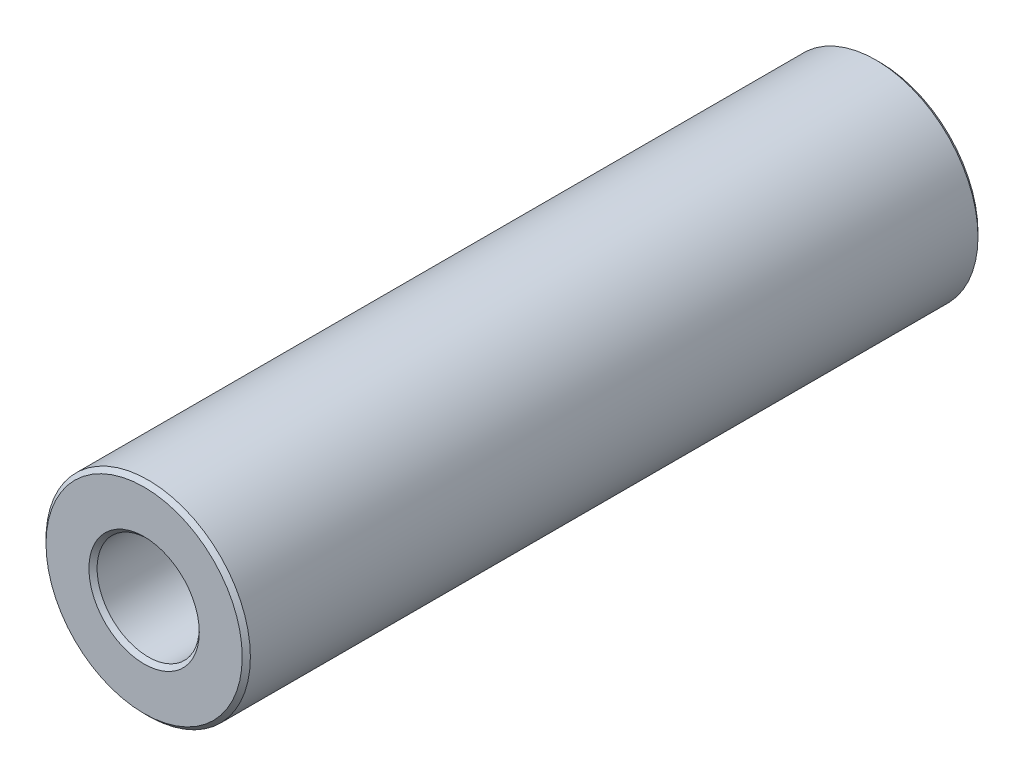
from build123d import *

# Parameters (mm, degrees)
SKETCH1_R           = 2.5
SKETCH1_R_2         = 1.25
BOSS_EXTRUDE2_DEPTH = 9
CHAMFER3_SIZE       = 0.1


with BuildPart() as part:
    # Sketch1 → Boss-Extrude2 (new, symmetric)
    with BuildSketch(Plane.XY):
        Circle(SKETCH1_R)
        Circle(SKETCH1_R_2, mode=Mode.SUBTRACT)
    extrude(amount=BOSS_EXTRUDE2_DEPTH, both=True)

    # Chamfer3
    chamfer3_edges = [part.edges().sort_by_distance(p)[0] for p in [
        (-2.5, 0, -9),
        (-2.5, 0, 9),
        (-1.25, 0, -9),
        (-1.25, 0, 9),
    ]]
    chamfer(chamfer3_edges, length=CHAMFER3_SIZE)


solid = part.part
